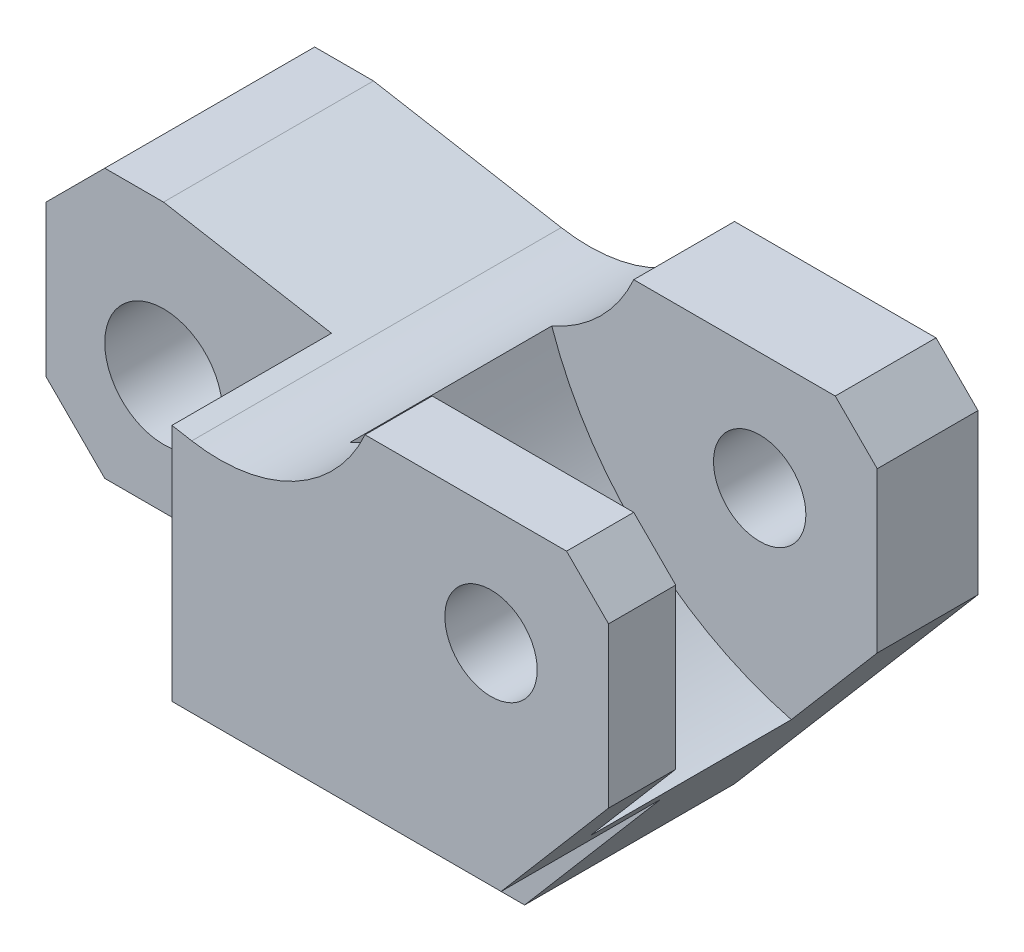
from build123d import *

# Parameters (mm, degrees)
BOSS_EXTRUDE1_DEPTH = 22
CHAMFER1_SIZE       = 7
CHAMFER2_SIZE       = 5
SKETCH2_R           = 7
CUT_EXTRUDE1_DEPTH  = 105.177732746
SKETCH3_W           = 34
SKETCH3_H           = 19
CUT_EXTRUDE2_DEPTH  = 107.037729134
CUT_EXTRUDE3_DEPTH  = 19
CUT_EXTRUDE4_START  = -24
CUT_EXTRUDE4_DEPTH  = 24
SKETCH6_R           = 5.5
CUT_EXTRUDE5_DEPTH  = 105.177732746


with BuildPart() as part:
    # Sketch1 → Boss-Extrude1 (new, symmetric)
    with BuildSketch(Plane.XY):
        with BuildLine():
            Line((0, 0), (0, 32))
            Line((0, 32), (14, 32))
            Line((14, 32), (36.361380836, 28.057085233))
            ThreePointArc((36.361380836, 28.057085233), (48.561098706, 29.982044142), (57, 39))
            Line((57, 39), (86, 39))
            Line((86, 39), (86, 15))
            Line((86, 15), (57, -19))
            Line((57, -19), (51.296980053, -19))
            ThreePointArc((51.296980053, -19), (46.858007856, -12.115672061), (44.521177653, -4.264705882))
            ThreePointArc((44.521177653, -4.264705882), (42.840774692, -1.213413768), (39.575538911, 0))
            Line((39.575538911, 0), (0, 0))
        make_face()
    extrude(amount=BOSS_EXTRUDE1_DEPTH, both=True)

    # Chamfer1
    chamfer1_edges = [part.edges().sort_by_distance(p)[0] for p in [
        (0, 0, 0),
        (0, 32, 0),
    ]]
    chamfer(chamfer1_edges, length=CHAMFER1_SIZE)

    # Chamfer2
    chamfer2_edges = [part.edges().sort_by_distance(p)[0] for p in [
        (86, 39, 0),
    ]]
    chamfer(chamfer2_edges, length=CHAMFER2_SIZE)

    # Sketch2 → Cut-Extrude1 (cut, through all)
    with BuildSketch(Plane.XY.offset(22)):
        with Locations((14, 14)):
            Circle(SKETCH2_R)
    extrude(amount=-CUT_EXTRUDE1_DEPTH, mode=Mode.SUBTRACT)

    # Sketch3 → Cut-Extrude2 (cut, through all)
    with BuildSketch(Plane(origin=(0, 39, 0), x_dir=(1, 0, 0), z_dir=(0, 1, 0))):
        with Locations((17, -12.5)):
            Rectangle(SKETCH3_W, SKETCH3_H)
    extrude(amount=-CUT_EXTRUDE2_DEPTH, mode=Mode.SUBTRACT)

    # Sketch4 → Cut-Extrude3 (cut)
    with BuildSketch(Plane.XY.offset(22)):
        with BuildLine():
            Line((39.575538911, 0), (73.205882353, 0))
            Line((73.205882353, 0), (57, -19))
            Line((57, -19), (51.296980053, -19))
            ThreePointArc((51.296980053, -19), (46.858007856, -12.115672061), (44.521177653, -4.264705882))
            ThreePointArc((44.521177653, -4.264705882), (42.840774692, -1.213413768), (39.575538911, 0))
        make_face()
    extrude(amount=-CUT_EXTRUDE3_DEPTH, mode=Mode.SUBTRACT)

    # Sketch5 → Cut-Extrude4 (cut)
    with BuildSketch(Plane(origin=(0, 0, -10), x_dir=(-1, 0, 0), z_dir=(0, 0, -1)).offset(CUT_EXTRUDE4_START)):
        with BuildLine():
            Line((-75.764705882, 3), (-86, 15))
            Line((-86, 15), (-86, 34))
            Line((-86, 34), (-81, 39))
            Line((-81, 39), (-57, 39))
            ThreePointArc((-57, 39), (-53.021244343, 33.259333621), (-47.236936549, 29.344294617))
            ThreePointArc((-47.236936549, 29.344294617), (-58.184262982, 12.580705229), (-75.764705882, 3))
        make_face()
    extrude(amount=CUT_EXTRUDE4_DEPTH, mode=Mode.SUBTRACT)

    # Sketch6 → Cut-Extrude5 (cut, through all)
    with BuildSketch(Plane.XY.offset(22)):
        with Locations((72, 25)):
            Circle(SKETCH6_R)
    extrude(amount=-CUT_EXTRUDE5_DEPTH, mode=Mode.SUBTRACT)


solid = part.part
